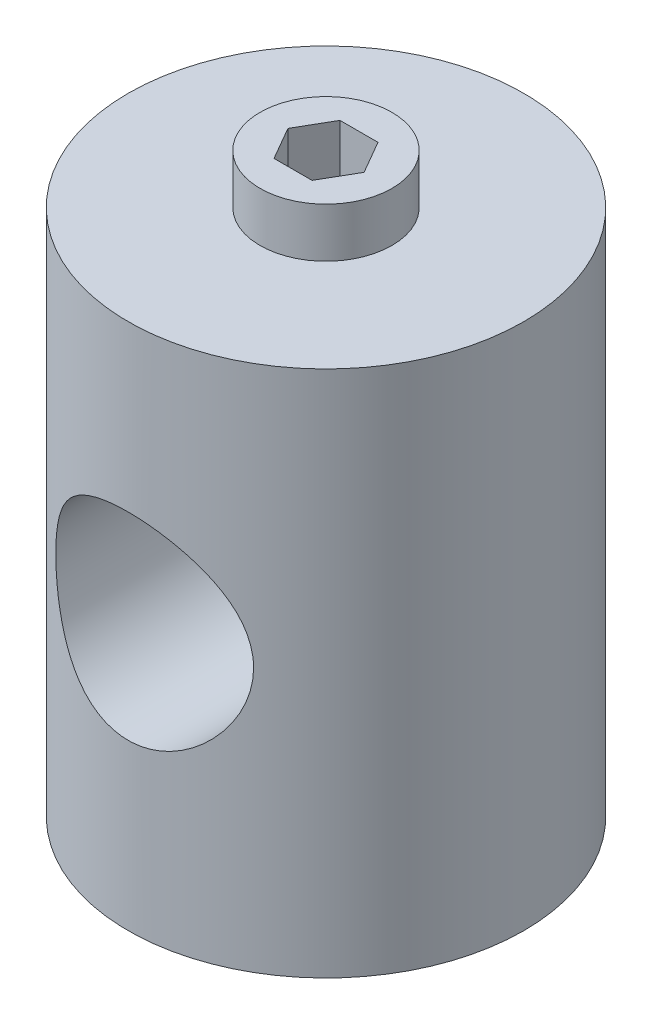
ISO-10303-21;
HEADER;
FILE_DESCRIPTION(('STEP AP214'),'2;1');
FILE_NAME('part.step','',(''),(''),'','','');
FILE_SCHEMA(('AUTOMOTIVE_DESIGN { 1 0 10303 214 1 1 1 1 }'));
ENDSEC;
DATA;
#1=APPLICATION_CONTEXT('core data for automotive mechanical design processes');
#2=APPLICATION_PROTOCOL_DEFINITION('international standard','automotive_design',2000,#1);
#3=PRODUCT_CONTEXT('',#1,'mechanical');
#4=PRODUCT('Part','Part','',(#3));
#5=PRODUCT_RELATED_PRODUCT_CATEGORY('part','',(#4));
#6=PRODUCT_DEFINITION_FORMATION('','',#4);
#7=PRODUCT_DEFINITION_CONTEXT('part definition',#1,'design');
#8=PRODUCT_DEFINITION('design','',#6,#7);
#9=PRODUCT_DEFINITION_SHAPE('','',#8);
#10=(LENGTH_UNIT() NAMED_UNIT(*) SI_UNIT(.MILLI.,.METRE.));
#11=(NAMED_UNIT(*) PLANE_ANGLE_UNIT() SI_UNIT($,.RADIAN.));
#12=(NAMED_UNIT(*) SI_UNIT($,.STERADIAN.) SOLID_ANGLE_UNIT());
#13=UNCERTAINTY_MEASURE_WITH_UNIT(LENGTH_MEASURE(1.E-05),#10,'distance_accuracy_value','');
#14=(GEOMETRIC_REPRESENTATION_CONTEXT(3) GLOBAL_UNCERTAINTY_ASSIGNED_CONTEXT((#13)) GLOBAL_UNIT_ASSIGNED_CONTEXT((#10,
#11,#12)) REPRESENTATION_CONTEXT('',''));
#15=CARTESIAN_POINT('',(0.,0.,0.));
#16=DIRECTION('',(0.,0.,1.));
#17=DIRECTION('',(1.,0.,0.));
#18=AXIS2_PLACEMENT_3D('',#15,#16,#17);
#19=CARTESIAN_POINT('',(-0.577350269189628,8.,-1.));
#20=DIRECTION('',(0.,-1.,0.));
#21=DIRECTION('',(1.,0.,0.));
#22=AXIS2_PLACEMENT_3D('',#19,#20,#21);
#23=PLANE('',#22);
#24=DIRECTION('',(-0.5,0.,0.866025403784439));
#25=VECTOR('',#24,1.);
#26=CARTESIAN_POINT('',(-0.577350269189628,8.,-1.));
#27=LINE('',#26,#25);
#28=CARTESIAN_POINT('',(-0.577350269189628,8.,-1.));
#29=VERTEX_POINT('',#28);
#30=CARTESIAN_POINT('',(-1.15470053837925,8.,0.));
#31=VERTEX_POINT('',#30);
#32=EDGE_CURVE('E169',#29,#31,#27,.T.);
#33=ORIENTED_EDGE('',*,*,#32,.T.);
#34=DIRECTION('',(0.5,0.,0.866025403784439));
#35=VECTOR('',#34,1.);
#36=CARTESIAN_POINT('',(-1.15470053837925,8.,0.));
#37=LINE('',#36,#35);
#38=CARTESIAN_POINT('',(-0.577350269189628,8.,1.));
#39=VERTEX_POINT('',#38);
#40=EDGE_CURVE('E91',#31,#39,#37,.T.);
#41=ORIENTED_EDGE('',*,*,#40,.T.);
#42=DIRECTION('',(1.,0.,0.));
#43=VECTOR('',#42,1.);
#44=CARTESIAN_POINT('',(-0.577350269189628,8.,1.));
#45=LINE('',#44,#43);
#46=CARTESIAN_POINT('',(0.577350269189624,8.,1.));
#47=VERTEX_POINT('',#46);
#48=EDGE_CURVE('E165',#39,#47,#45,.T.);
#49=ORIENTED_EDGE('',*,*,#48,.T.);
#50=DIRECTION('',(0.5,0.,-0.866025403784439));
#51=VECTOR('',#50,1.);
#52=CARTESIAN_POINT('',(0.577350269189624,8.,1.));
#53=LINE('',#52,#51);
#54=CARTESIAN_POINT('',(1.15470053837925,8.,0.));
#55=VERTEX_POINT('',#54);
#56=EDGE_CURVE('E162',#47,#55,#53,.T.);
#57=ORIENTED_EDGE('',*,*,#56,.T.);
#58=DIRECTION('',(-0.5,0.,-0.866025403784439));
#59=VECTOR('',#58,1.);
#60=CARTESIAN_POINT('',(1.15470053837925,8.,0.));
#61=LINE('',#60,#59);
#62=CARTESIAN_POINT('',(0.577350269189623,8.,-1.));
#63=VERTEX_POINT('',#62);
#64=EDGE_CURVE('E159',#55,#63,#61,.T.);
#65=ORIENTED_EDGE('',*,*,#64,.T.);
#66=DIRECTION('',(-1.,0.,0.));
#67=VECTOR('',#66,1.);
#68=CARTESIAN_POINT('',(0.577350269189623,8.,-1.));
#69=LINE('',#68,#67);
#70=EDGE_CURVE('E93',#63,#29,#69,.T.);
#71=ORIENTED_EDGE('',*,*,#70,.T.);
#72=EDGE_LOOP('',(#33,#41,#49,#57,#65,#71));
#73=FACE_BOUND('',#72,.T.);
#74=ADVANCED_FACE('F14',(#73),#23,.F.);
#75=CARTESIAN_POINT('',(-0.577350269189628,8.,1.));
#76=DIRECTION('',(0.,0.,1.));
#77=DIRECTION('',(1.,0.,0.));
#78=AXIS2_PLACEMENT_3D('',#75,#76,#77);
#79=PLANE('',#78);
#80=DIRECTION('',(1.,0.,0.));
#81=VECTOR('',#80,1.);
#82=CARTESIAN_POINT('',(-0.577350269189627,9.5,1.));
#83=LINE('',#82,#81);
#84=CARTESIAN_POINT('',(-0.577350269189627,9.5,1.));
#85=VERTEX_POINT('',#84);
#86=CARTESIAN_POINT('',(0.577350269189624,9.5,1.));
#87=VERTEX_POINT('',#86);
#88=EDGE_CURVE('E98',#85,#87,#83,.T.);
#89=ORIENTED_EDGE('',*,*,#88,.T.);
#90=DIRECTION('',(0.,1.,0.));
#91=VECTOR('',#90,1.);
#92=CARTESIAN_POINT('',(0.577350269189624,8.,1.));
#93=LINE('',#92,#91);
#94=EDGE_CURVE('E43',#47,#87,#93,.T.);
#95=ORIENTED_EDGE('',*,*,#94,.F.);
#96=ORIENTED_EDGE('',*,*,#48,.F.);
#97=DIRECTION('',(0.,1.,0.));
#98=VECTOR('',#97,1.);
#99=CARTESIAN_POINT('',(-0.577350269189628,8.,1.));
#100=LINE('',#99,#98);
#101=EDGE_CURVE('E35',#39,#85,#100,.T.);
#102=ORIENTED_EDGE('',*,*,#101,.T.);
#103=EDGE_LOOP('',(#89,#95,#96,#102));
#104=FACE_BOUND('',#103,.T.);
#105=ADVANCED_FACE('F182',(#104),#79,.F.);
#106=CARTESIAN_POINT('',(0.577350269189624,8.,1.));
#107=DIRECTION('',(0.866025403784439,0.,0.5));
#108=DIRECTION('',(0.5,0.,-0.866025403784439));
#109=AXIS2_PLACEMENT_3D('',#106,#107,#108);
#110=PLANE('',#109);
#111=DIRECTION('',(0.5,0.,-0.866025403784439));
#112=VECTOR('',#111,1.);
#113=CARTESIAN_POINT('',(0.577350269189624,9.5,1.));
#114=LINE('',#113,#112);
#115=CARTESIAN_POINT('',(1.15470053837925,9.5,0.));
#116=VERTEX_POINT('',#115);
#117=EDGE_CURVE('E100',#87,#116,#114,.T.);
#118=ORIENTED_EDGE('',*,*,#117,.T.);
#119=DIRECTION('',(0.,1.,0.));
#120=VECTOR('',#119,1.);
#121=CARTESIAN_POINT('',(1.15470053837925,8.,0.));
#122=LINE('',#121,#120);
#123=EDGE_CURVE('E152',#55,#116,#122,.T.);
#124=ORIENTED_EDGE('',*,*,#123,.F.);
#125=ORIENTED_EDGE('',*,*,#56,.F.);
#126=ORIENTED_EDGE('',*,*,#94,.T.);
#127=EDGE_LOOP('',(#118,#124,#125,#126));
#128=FACE_BOUND('',#127,.T.);
#129=ADVANCED_FACE('F176',(#128),#110,.F.);
#130=CARTESIAN_POINT('',(1.15470053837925,8.,0.));
#131=DIRECTION('',(0.866025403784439,0.,-0.5));
#132=DIRECTION('',(-0.5,0.,-0.866025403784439));
#133=AXIS2_PLACEMENT_3D('',#130,#131,#132);
#134=PLANE('',#133);
#135=DIRECTION('',(-0.5,0.,-0.866025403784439));
#136=VECTOR('',#135,1.);
#137=CARTESIAN_POINT('',(1.15470053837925,9.5,0.));
#138=LINE('',#137,#136);
#139=CARTESIAN_POINT('',(0.577350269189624,9.5,-1.));
#140=VERTEX_POINT('',#139);
#141=EDGE_CURVE('E173',#116,#140,#138,.T.);
#142=ORIENTED_EDGE('',*,*,#141,.T.);
#143=DIRECTION('',(0.,1.,0.));
#144=VECTOR('',#143,1.);
#145=CARTESIAN_POINT('',(0.577350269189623,8.,-1.));
#146=LINE('',#145,#144);
#147=EDGE_CURVE('E154',#63,#140,#146,.T.);
#148=ORIENTED_EDGE('',*,*,#147,.F.);
#149=ORIENTED_EDGE('',*,*,#64,.F.);
#150=ORIENTED_EDGE('',*,*,#123,.T.);
#151=EDGE_LOOP('',(#142,#148,#149,#150));
#152=FACE_BOUND('',#151,.T.);
#153=ADVANCED_FACE('F179',(#152),#134,.F.);
#154=CARTESIAN_POINT('',(0.577350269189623,8.,-1.));
#155=DIRECTION('',(0.,0.,-1.));
#156=DIRECTION('',(-1.,0.,0.));
#157=AXIS2_PLACEMENT_3D('',#154,#155,#156);
#158=PLANE('',#157);
#159=DIRECTION('',(-1.,0.,0.));
#160=VECTOR('',#159,1.);
#161=CARTESIAN_POINT('',(0.577350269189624,9.5,-1.));
#162=LINE('',#161,#160);
#163=CARTESIAN_POINT('',(-0.577350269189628,9.5,-1.));
#164=VERTEX_POINT('',#163);
#165=EDGE_CURVE('E171',#140,#164,#162,.T.);
#166=ORIENTED_EDGE('',*,*,#165,.T.);
#167=DIRECTION('',(0.,1.,0.));
#168=VECTOR('',#167,1.);
#169=CARTESIAN_POINT('',(-0.577350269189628,8.,-1.));
#170=LINE('',#169,#168);
#171=EDGE_CURVE('E79',#29,#164,#170,.T.);
#172=ORIENTED_EDGE('',*,*,#171,.F.);
#173=ORIENTED_EDGE('',*,*,#70,.F.);
#174=ORIENTED_EDGE('',*,*,#147,.T.);
#175=EDGE_LOOP('',(#166,#172,#173,#174));
#176=FACE_BOUND('',#175,.T.);
#177=ADVANCED_FACE('F273',(#176),#158,.F.);
#178=CARTESIAN_POINT('',(-0.577350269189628,8.,-1.));
#179=DIRECTION('',(-0.866025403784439,0.,-0.5));
#180=DIRECTION('',(-0.5,0.,0.866025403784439));
#181=AXIS2_PLACEMENT_3D('',#178,#179,#180);
#182=PLANE('',#181);
#183=DIRECTION('',(-0.5,0.,0.866025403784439));
#184=VECTOR('',#183,1.);
#185=CARTESIAN_POINT('',(-0.577350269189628,9.5,-1.));
#186=LINE('',#185,#184);
#187=CARTESIAN_POINT('',(-1.15470053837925,9.5,0.));
#188=VERTEX_POINT('',#187);
#189=EDGE_CURVE('E73',#164,#188,#186,.T.);
#190=ORIENTED_EDGE('',*,*,#189,.T.);
#191=DIRECTION('',(0.,1.,0.));
#192=VECTOR('',#191,1.);
#193=CARTESIAN_POINT('',(-1.15470053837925,8.,0.));
#194=LINE('',#193,#192);
#195=EDGE_CURVE('E77',#31,#188,#194,.T.);
#196=ORIENTED_EDGE('',*,*,#195,.F.);
#197=ORIENTED_EDGE('',*,*,#32,.F.);
#198=ORIENTED_EDGE('',*,*,#171,.T.);
#199=EDGE_LOOP('',(#190,#196,#197,#198));
#200=FACE_BOUND('',#199,.T.);
#201=ADVANCED_FACE('F75',(#200),#182,.F.);
#202=CARTESIAN_POINT('',(-1.15470053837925,8.,0.));
#203=DIRECTION('',(-0.866025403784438,0.,0.5));
#204=DIRECTION('',(0.5,0.,0.866025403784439));
#205=AXIS2_PLACEMENT_3D('',#202,#203,#204);
#206=PLANE('',#205);
#207=DIRECTION('',(0.5,0.,0.866025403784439));
#208=VECTOR('',#207,1.);
#209=CARTESIAN_POINT('',(-1.15470053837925,9.5,0.));
#210=LINE('',#209,#208);
#211=EDGE_CURVE('E85',#188,#85,#210,.T.);
#212=ORIENTED_EDGE('',*,*,#211,.T.);
#213=ORIENTED_EDGE('',*,*,#101,.F.);
#214=ORIENTED_EDGE('',*,*,#40,.F.);
#215=ORIENTED_EDGE('',*,*,#195,.T.);
#216=EDGE_LOOP('',(#212,#213,#214,#215));
#217=FACE_BOUND('',#216,.T.);
#218=ADVANCED_FACE('F88',(#217),#206,.F.);
#219=CARTESIAN_POINT('',(0.,9.5,0.));
#220=DIRECTION('',(0.,-1.,0.));
#221=DIRECTION('',(1.,0.,0.));
#222=AXIS2_PLACEMENT_3D('',#219,#220,#221);
#223=PLANE('',#222);
#224=ORIENTED_EDGE('',*,*,#211,.F.);
#225=ORIENTED_EDGE('',*,*,#189,.F.);
#226=ORIENTED_EDGE('',*,*,#165,.F.);
#227=ORIENTED_EDGE('',*,*,#141,.F.);
#228=ORIENTED_EDGE('',*,*,#117,.F.);
#229=ORIENTED_EDGE('',*,*,#88,.F.);
#230=EDGE_LOOP('',(#224,#225,#226,#227,#228,#229));
#231=FACE_BOUND('',#230,.T.);
#232=CARTESIAN_POINT('',(0.,9.5,0.));
#233=DIRECTION('',(0.,-1.,0.));
#234=DIRECTION('',(1.,0.,0.));
#235=AXIS2_PLACEMENT_3D('',#232,#233,#234);
#236=CIRCLE('',#235,2.);
#237=CARTESIAN_POINT('',(2.,9.5,0.));
#238=VERTEX_POINT('',#237);
#239=EDGE_CURVE('E147',#238,#238,#236,.T.);
#240=ORIENTED_EDGE('',*,*,#239,.F.);
#241=EDGE_LOOP('',(#240));
#242=FACE_BOUND('',#241,.T.);
#243=ADVANCED_FACE('F95',(#231,#242),#223,.F.);
#244=CARTESIAN_POINT('',(0.,5.5,0.));
#245=DIRECTION('',(0.,-1.,0.));
#246=DIRECTION('',(1.,0.,0.));
#247=AXIS2_PLACEMENT_3D('',#244,#245,#246);
#248=CYLINDRICAL_SURFACE('',#247,2.);
#249=ORIENTED_EDGE('',*,*,#239,.T.);
#250=EDGE_LOOP('',(#249));
#251=FACE_BOUND('',#250,.T.);
#252=CARTESIAN_POINT('',(0.,8.,0.));
#253=DIRECTION('',(0.,-1.,0.));
#254=DIRECTION('',(1.,0.,0.));
#255=AXIS2_PLACEMENT_3D('',#252,#253,#254);
#256=CIRCLE('',#255,2.);
#257=CARTESIAN_POINT('',(2.,8.,0.));
#258=VERTEX_POINT('',#257);
#259=EDGE_CURVE('E144',#258,#258,#256,.T.);
#260=ORIENTED_EDGE('',*,*,#259,.F.);
#261=EDGE_LOOP('',(#260));
#262=FACE_BOUND('',#261,.T.);
#263=ADVANCED_FACE('F131',(#251,#262),#248,.T.);
#264=CARTESIAN_POINT('',(0.,-8.,0.));
#265=DIRECTION('',(0.,-1.,0.));
#266=DIRECTION('',(1.,0.,0.));
#267=AXIS2_PLACEMENT_3D('',#264,#265,#266);
#268=PLANE('',#267);
#269=CARTESIAN_POINT('',(0.,-8.,0.));
#270=DIRECTION('',(0.,-1.,0.));
#271=DIRECTION('',(1.,0.,0.));
#272=AXIS2_PLACEMENT_3D('',#269,#270,#271);
#273=CIRCLE('',#272,6.);
#274=CARTESIAN_POINT('',(6.,-8.,0.));
#275=VERTEX_POINT('',#274);
#276=EDGE_CURVE('E111',#275,#275,#273,.T.);
#277=ORIENTED_EDGE('',*,*,#276,.T.);
#278=EDGE_LOOP('',(#277));
#279=FACE_BOUND('',#278,.T.);
#280=ADVANCED_FACE('F194',(#279),#268,.T.);
#281=CARTESIAN_POINT('',(0.,-8.,0.));
#282=DIRECTION('',(0.,1.,0.));
#283=DIRECTION('',(-1.,0.,0.));
#284=AXIS2_PLACEMENT_3D('',#281,#282,#283);
#285=CYLINDRICAL_SURFACE('',#284,6.);
#286=CARTESIAN_POINT('',(3.,0.,5.19615242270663));
#287=CARTESIAN_POINT('',(2.99999910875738,-0.0782002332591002,5.19615338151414));
#288=CARTESIAN_POINT('',(2.99693611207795,-0.156409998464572,5.19792581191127));
#289=CARTESIAN_POINT('',(2.98473565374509,-0.312208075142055,5.20493931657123));
#290=CARTESIAN_POINT('',(2.97559536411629,-0.389796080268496,5.21018200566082));
#291=CARTESIAN_POINT('',(2.9391691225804,-0.620944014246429,5.23088200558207));
#292=CARTESIAN_POINT('',(2.90287805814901,-0.772750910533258,5.25131076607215));
#293=CARTESIAN_POINT('',(2.80829998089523,-1.06639163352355,5.30247746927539));
#294=CARTESIAN_POINT('',(2.75012989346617,-1.2082738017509,5.33316051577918));
#295=CARTESIAN_POINT('',(2.61380253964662,-1.48026276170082,5.40128072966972));
#296=CARTESIAN_POINT('',(2.53564419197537,-1.61036891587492,5.43871826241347));
#297=CARTESIAN_POINT('',(2.35399963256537,-1.86692014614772,5.51990583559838));
#298=CARTESIAN_POINT('',(2.24895611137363,-1.99217820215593,5.56392184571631));
#299=CARTESIAN_POINT('',(2.01976141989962,-2.22422436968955,5.651159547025));
#300=CARTESIAN_POINT('',(1.89560077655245,-2.3310032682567,5.69438083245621));
#301=CARTESIAN_POINT('',(1.62146869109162,-2.53010168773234,5.77864428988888));
#302=CARTESIAN_POINT('',(1.47032156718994,-2.62096136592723,5.81934318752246));
#303=CARTESIAN_POINT('',(1.15247107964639,-2.77542249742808,5.89052268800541));
#304=CARTESIAN_POINT('',(0.985777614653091,-2.83904115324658,5.92100973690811));
#305=CARTESIAN_POINT('',(0.654134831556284,-2.93251399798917,5.96641383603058));
#306=CARTESIAN_POINT('',(0.489905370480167,-2.96444857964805,5.98228440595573));
#307=CARTESIAN_POINT('',(0.157711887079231,-3.00049835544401,6.00022751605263));
#308=CARTESIAN_POINT('',(-0.0102498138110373,-3.00463038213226,6.00230840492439));
#309=CARTESIAN_POINT('',(-0.32949757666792,-2.98575996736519,5.9928894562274));
#310=CARTESIAN_POINT('',(-0.48096360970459,-2.96508591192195,5.98255487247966));
#311=CARTESIAN_POINT('',(-0.77794130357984,-2.90135750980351,5.9512273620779));
#312=CARTESIAN_POINT('',(-0.923452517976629,-2.85830148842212,5.93023363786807));
#313=CARTESIAN_POINT('',(-1.20692822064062,-2.75075214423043,5.87914748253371));
#314=CARTESIAN_POINT('',(-1.34476044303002,-2.68597046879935,5.8489331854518));
#315=CARTESIAN_POINT('',(-1.60793023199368,-2.53721034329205,5.78212944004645));
#316=CARTESIAN_POINT('',(-1.73326330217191,-2.45322502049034,5.74553771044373));
#317=CARTESIAN_POINT('',(-1.98052168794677,-2.25931152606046,5.66533158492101));
#318=CARTESIAN_POINT('',(-2.10100497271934,-2.14768148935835,5.62138031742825));
#319=CARTESIAN_POINT('',(-2.32231036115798,-1.90624025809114,5.53363118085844));
#320=CARTESIAN_POINT('',(-2.42311733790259,-1.77641520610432,5.48983345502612));
#321=CARTESIAN_POINT('',(-2.6085269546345,-1.49201785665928,5.40432084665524));
#322=CARTESIAN_POINT('',(-2.691694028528,-1.33639756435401,5.36291485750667));
#323=CARTESIAN_POINT('',(-2.79542837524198,-1.09243694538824,5.30915194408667));
#324=CARTESIAN_POINT('',(-2.82650797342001,-1.00934368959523,5.2926194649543));
#325=CARTESIAN_POINT('',(-2.88131297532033,-0.840191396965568,5.26298473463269));
#326=CARTESIAN_POINT('',(-2.90504291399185,-0.754134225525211,5.24988036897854));
#327=CARTESIAN_POINT('',(-2.94323927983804,-0.586628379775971,5.22855455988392));
#328=CARTESIAN_POINT('',(-2.95828810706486,-0.505350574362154,5.22002982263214));
#329=CARTESIAN_POINT('',(-2.98163903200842,-0.341564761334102,5.20672737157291));
#330=CARTESIAN_POINT('',(-2.98994463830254,-0.259057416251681,5.20194770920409));
#331=CARTESIAN_POINT('',(-2.99968663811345,-0.0935289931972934,5.19633662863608));
#332=CARTESIAN_POINT('',(-3.00112558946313,-0.0105081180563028,5.19550374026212));
#333=CARTESIAN_POINT('',(-2.99712742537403,0.155286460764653,5.19780953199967));
#334=CARTESIAN_POINT('',(-2.99169077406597,0.238060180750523,5.20094794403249));
#335=CARTESIAN_POINT('',(-2.96710135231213,0.466859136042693,5.21504493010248));
#336=CARTESIAN_POINT('',(-2.9405616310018,0.611910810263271,5.23019160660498));
#337=CARTESIAN_POINT('',(-2.86709067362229,0.895130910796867,5.27081666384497));
#338=CARTESIAN_POINT('',(-2.82015283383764,1.03329709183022,5.29629839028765));
#339=CARTESIAN_POINT('',(-2.70494224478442,1.30622610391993,5.35608780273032));
#340=CARTESIAN_POINT('',(-2.63578205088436,1.4405349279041,5.3907496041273));
#341=CARTESIAN_POINT('',(-2.47886133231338,1.69640993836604,5.46468327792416));
#342=CARTESIAN_POINT('',(-2.3910912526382,1.81796953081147,5.50395751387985));
#343=CARTESIAN_POINT('',(-2.18651145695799,2.06093562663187,5.58864005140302));
#344=CARTESIAN_POINT('',(-2.067435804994,2.18039127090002,5.63419752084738));
#345=CARTESIAN_POINT('',(-1.8102134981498,2.39823689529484,5.72202702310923));
#346=CARTESIAN_POINT('',(-1.67206042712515,2.4966197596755,5.76429794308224));
#347=CARTESIAN_POINT('',(-1.37560608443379,2.67172112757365,5.84224085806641));
#348=CARTESIAN_POINT('',(-1.21686929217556,2.74779934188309,5.87770925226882));
#349=CARTESIAN_POINT('',(-0.886567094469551,2.87141372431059,5.93650064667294));
#350=CARTESIAN_POINT('',(-0.715013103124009,2.91897495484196,5.95983430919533));
#351=CARTESIAN_POINT('',(-0.380939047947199,2.98010569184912,5.9900252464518));
#352=CARTESIAN_POINT('',(-0.219034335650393,2.99639363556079,5.99819783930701));
#353=CARTESIAN_POINT('',(0.105377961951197,3.00252978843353,6.00126390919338));
#354=CARTESIAN_POINT('',(0.267885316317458,2.99238725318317,5.99616203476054));
#355=CARTESIAN_POINT('',(0.577613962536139,2.94775080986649,5.97401907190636));
#356=CARTESIAN_POINT('',(0.725136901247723,2.91490556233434,5.95778686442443));
#357=CARTESIAN_POINT('',(1.01233790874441,2.82801889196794,5.91576278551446));
#358=CARTESIAN_POINT('',(1.15201484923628,2.77397442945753,5.88996954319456));
#359=CARTESIAN_POINT('',(1.42627001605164,2.64381927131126,5.829778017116));
#360=CARTESIAN_POINT('',(1.56037465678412,2.56686365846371,5.79505887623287));
#361=CARTESIAN_POINT('',(1.81432469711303,2.39412457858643,5.7206436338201));
#362=CARTESIAN_POINT('',(1.93416350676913,2.29833246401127,5.6809452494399));
#363=CARTESIAN_POINT('',(2.16873884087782,2.07961527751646,5.59585978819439));
#364=CARTESIAN_POINT('',(2.28178066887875,1.9549386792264,5.55029975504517));
#365=CARTESIAN_POINT('',(2.48600225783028,1.68762167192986,5.46188649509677));
#366=CARTESIAN_POINT('',(2.57716267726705,1.54496553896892,5.41903568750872));
#367=CARTESIAN_POINT('',(2.69665559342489,1.31746820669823,5.36004774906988));
#368=CARTESIAN_POINT('',(2.73405408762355,1.23802419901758,5.34101219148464));
#369=CARTESIAN_POINT('',(2.80191257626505,1.07564671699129,5.30572783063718));
#370=CARTESIAN_POINT('',(2.83237614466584,0.992715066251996,5.28947759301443));
#371=CARTESIAN_POINT('',(2.88592624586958,0.824155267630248,5.26045215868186));
#372=CARTESIAN_POINT('',(2.90903175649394,0.738534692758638,5.24766803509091));
#373=CARTESIAN_POINT('',(2.9476242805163,0.565144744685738,5.22608869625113));
#374=CARTESIAN_POINT('',(2.96311662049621,0.47737691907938,5.21729069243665));
#375=CARTESIAN_POINT('',(2.9830938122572,0.324601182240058,5.20588528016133));
#376=CARTESIAN_POINT('',(2.9894274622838,0.259905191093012,5.20224442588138));
#377=CARTESIAN_POINT('',(2.99788106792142,0.130141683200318,5.19737751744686));
#378=CARTESIAN_POINT('',(3.00000074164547,0.0650741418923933,5.1961516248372));
#379=CARTESIAN_POINT('',(3.,0.,5.19615242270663));
#380=B_SPLINE_CURVE_WITH_KNOTS('',3,(#286,#287,#288,#289,#290,#291,#292,#293,#294,#295,#296,
#297,#298,#299,#300,#301,#302,#303,#304,#305,#306,#307,#308,#309,#310,#311,#312,#313,#314,#315,
#316,#317,#318,#319,#320,#321,#322,#323,#324,#325,#326,#327,#328,#329,#330,#331,#332,#333,#334,
#335,#336,#337,#338,#339,#340,#341,#342,#343,#344,#345,#346,#347,#348,#349,#350,#351,#352,#353,
#354,#355,#356,#357,#358,#359,#360,#361,#362,#363,#364,#365,#366,#367,#368,#369,#370,#371,#372,
#373,#374,#375,#376,#377,#378,#379),.UNSPECIFIED.,.T.,.F.,(4,2,2,2,2,2,2,2,2,2,2,2,2,2,2,2,2,2,
2,2,2,2,2,2,2,2,2,2,2,2,2,2,2,2,2,2,2,2,2,2,2,2,2,2,2,2,4),(0.,0.234529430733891,
0.469168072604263,0.93885038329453,1.40605749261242,1.87328988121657,2.37905864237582,
2.88507883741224,3.42520847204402,3.96499651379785,4.46637625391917,4.96745241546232,
5.42495462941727,5.88249108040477,6.34635774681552,6.81039068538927,7.31828744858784,
7.82657315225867,8.36713695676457,8.63752916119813,8.90775419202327,9.15669600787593,
9.40550821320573,9.65422772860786,9.90293045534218,10.3454331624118,10.7880792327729,
11.2512265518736,11.7146122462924,12.2364099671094,12.7583836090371,13.29413310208,
13.8294110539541,14.3155757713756,14.8015702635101,15.2555404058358,15.7095756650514,
16.1830301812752,16.6567025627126,17.177514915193,17.6987859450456,17.9680115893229,
18.2370981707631,18.5054849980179,18.7736837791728,18.9688338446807,19.1639969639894),.UNSPECIFIED.);
#381=CARTESIAN_POINT('',(3.,0.,5.19615242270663));
#382=VERTEX_POINT('',#381);
#383=EDGE_CURVE('E28',#382,#382,#380,.T.);
#384=ORIENTED_EDGE('',*,*,#383,.T.);
#385=EDGE_LOOP('',(#384));
#386=FACE_BOUND('',#385,.T.);
#387=CARTESIAN_POINT('',(0.,3.,-6.));
#388=CARTESIAN_POINT('',(-0.0788941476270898,2.99999916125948,-5.99999934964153));
#389=CARTESIAN_POINT('',(-0.15779662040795,2.99688205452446,-5.99843869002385));
#390=CARTESIAN_POINT('',(-0.315001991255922,2.98446072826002,-5.99224358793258));
#391=CARTESIAN_POINT('',(-0.393304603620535,2.97515372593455,-5.98760776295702));
#392=CARTESIAN_POINT('',(-0.626628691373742,2.93804214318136,-5.96921978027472));
#393=CARTESIAN_POINT('',(-0.779952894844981,2.90104717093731,-5.95098734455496));
#394=CARTESIAN_POINT('',(-1.07683586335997,2.80441822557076,-5.90448966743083));
#395=CARTESIAN_POINT('',(-1.22043005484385,2.74487223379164,-5.87626344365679));
#396=CARTESIAN_POINT('',(-1.49540820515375,2.60528874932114,-5.81237302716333));
#397=CARTESIAN_POINT('',(-1.62679312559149,2.52525287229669,-5.77670942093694));
#398=CARTESIAN_POINT('',(-1.88252701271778,2.34144601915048,-5.69868752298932));
#399=CARTESIAN_POINT('',(-2.0059694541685,2.23653205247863,-5.65605474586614));
#400=CARTESIAN_POINT('',(-2.23433451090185,2.00844407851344,-5.5698003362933));
#401=CARTESIAN_POINT('',(-2.3392430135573,1.88525628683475,-5.52617797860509));
#402=CARTESIAN_POINT('',(-2.53576864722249,1.61251563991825,-5.43896347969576));
#403=CARTESIAN_POINT('',(-2.62572411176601,1.46165902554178,-5.39563602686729));
#404=CARTESIAN_POINT('',(-2.7403403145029,1.22404914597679,-5.33782449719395));
#405=CARTESIAN_POINT('',(-2.77516786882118,1.14292907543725,-5.31974570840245));
#406=CARTESIAN_POINT('',(-2.83769299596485,0.977399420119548,-5.28665768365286));
#407=CARTESIAN_POINT('',(-2.86539478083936,0.892991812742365,-5.27164663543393));
#408=CARTESIAN_POINT('',(-2.91188280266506,0.72660420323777,-5.24610341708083));
#409=CARTESIAN_POINT('',(-2.93110042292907,0.644777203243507,-5.23535838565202));
#410=CARTESIAN_POINT('',(-2.9626355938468,0.479445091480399,-5.21757784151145));
#411=CARTESIAN_POINT('',(-2.97495680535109,0.395940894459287,-5.21054036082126));
#412=CARTESIAN_POINT('',(-2.99251382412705,0.227993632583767,-5.20047756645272));
#413=CARTESIAN_POINT('',(-2.99775389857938,0.143551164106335,-5.19744983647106));
#414=CARTESIAN_POINT('',(-3.00108452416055,-0.02549365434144,-5.19552555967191));
#415=CARTESIAN_POINT('',(-2.99917575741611,-0.110095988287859,-5.19662861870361));
#416=CARTESIAN_POINT('',(-2.98404973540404,-0.342753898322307,-5.20534668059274));
#417=CARTESIAN_POINT('',(-2.96335042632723,-0.49024415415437,-5.21726794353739));
#418=CARTESIAN_POINT('',(-2.90082280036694,-0.779193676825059,-5.25228182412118));
#419=CARTESIAN_POINT('',(-2.85898775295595,-0.920651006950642,-5.27537800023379));
#420=CARTESIAN_POINT('',(-2.75462843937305,-1.19767965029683,-5.33062568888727));
#421=CARTESIAN_POINT('',(-2.69164495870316,-1.33303711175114,-5.36297559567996));
#422=CARTESIAN_POINT('',(-2.54712530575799,-1.59190496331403,-5.43310175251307));
#423=CARTESIAN_POINT('',(-2.46558080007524,-1.71540999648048,-5.47088043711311));
#424=CARTESIAN_POINT('',(-2.27419808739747,-1.96356309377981,-5.55339485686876));
#425=CARTESIAN_POINT('',(-2.16208335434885,-2.0863704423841,-5.59840533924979));
#426=CARTESIAN_POINT('',(-1.91866675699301,-2.31220643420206,-5.68642866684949));
#427=CARTESIAN_POINT('',(-1.78735577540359,-2.41522562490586,-5.72944054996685));
#428=CARTESIAN_POINT('',(-1.50154951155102,-2.60305693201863,-5.81105962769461));
#429=CARTESIAN_POINT('',(-1.3462607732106,-2.68680140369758,-5.84936952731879));
#430=CARTESIAN_POINT('',(-1.02139864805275,-2.82629110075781,-5.91473643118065));
#431=CARTESIAN_POINT('',(-0.851836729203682,-2.88205855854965,-5.94180236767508));
#432=CARTESIAN_POINT('',(-0.518299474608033,-2.95942620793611,-5.97973001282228));
#433=CARTESIAN_POINT('',(-0.355024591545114,-2.98347370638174,-5.99174814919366));
#434=CARTESIAN_POINT('',(-0.0263387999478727,-3.00439419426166,-6.00219040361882));
#435=CARTESIAN_POINT('',(0.139071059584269,-3.00128005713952,-6.00062096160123));
#436=CARTESIAN_POINT('',(0.453698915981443,-2.96937993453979,-5.98473576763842));
#437=CARTESIAN_POINT('',(0.603178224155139,-2.94260240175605,-5.97141737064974));
#438=CARTESIAN_POINT('',(0.895220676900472,-2.86728578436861,-5.93466513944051));
#439=CARTESIAN_POINT('',(1.03778305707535,-2.81874430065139,-5.91123019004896));
#440=CARTESIAN_POINT('',(1.31666582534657,-2.7000046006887,-5.85552754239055));
#441=CARTESIAN_POINT('',(1.45269119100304,-2.62922684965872,-5.82302645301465));
#442=CARTESIAN_POINT('',(1.71138408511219,-2.46867739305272,-5.75231922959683));
#443=CARTESIAN_POINT('',(1.83404588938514,-2.37889759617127,-5.71411066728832));
#444=CARTESIAN_POINT('',(2.07530306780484,-2.17271872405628,-5.63124663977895));
#445=CARTESIAN_POINT('',(2.19231623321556,-2.05457139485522,-5.58632654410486));
#446=CARTESIAN_POINT('',(2.40556896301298,-1.8002245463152,-5.49787174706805));
#447=CARTESIAN_POINT('',(2.50179415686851,-1.66401264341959,-5.45433802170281));
#448=CARTESIAN_POINT('',(2.675123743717,-1.36906903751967,-5.3715357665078));
#449=CARTESIAN_POINT('',(2.75107648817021,-1.20956620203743,-5.33257588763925));
#450=CARTESIAN_POINT('',(2.87424847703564,-0.877469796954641,-5.26722216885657));
#451=CARTESIAN_POINT('',(2.92150474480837,-0.704893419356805,-5.24081214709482));
#452=CARTESIAN_POINT('',(2.98158506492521,-0.369269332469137,-5.2068450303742));
#453=CARTESIAN_POINT('',(2.997278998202,-0.206897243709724,-5.19772150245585));
#454=CARTESIAN_POINT('',(3.00206745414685,0.118341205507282,-5.19496064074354));
#455=CARTESIAN_POINT('',(2.99117350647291,0.281207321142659,-5.20131659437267));
#456=CARTESIAN_POINT('',(2.94577840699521,0.586450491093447,-5.22713585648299));
#457=CARTESIAN_POINT('',(2.91362505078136,0.729301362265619,-5.24529281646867));
#458=CARTESIAN_POINT('',(2.82952596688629,1.0074244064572,-5.29113050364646));
#459=CARTESIAN_POINT('',(2.77757387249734,1.14269412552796,-5.3188142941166));
#460=CARTESIAN_POINT('',(2.65144766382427,1.41187436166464,-5.38285583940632));
#461=CARTESIAN_POINT('',(2.57601505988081,1.54508296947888,-5.41967139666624));
#462=CARTESIAN_POINT('',(2.40645126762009,1.7978243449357,-5.49706022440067));
#463=CARTESIAN_POINT('',(2.31231035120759,1.9173499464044,-5.5376354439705));
#464=CARTESIAN_POINT('',(2.094616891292,2.15442285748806,-5.62386853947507));
#465=CARTESIAN_POINT('',(1.96888052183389,2.26996512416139,-5.66954494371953));
#466=CARTESIAN_POINT('',(1.69843715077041,2.47880114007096,-5.75633712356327));
#467=CARTESIAN_POINT('',(1.55371998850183,2.57208289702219,-5.79745043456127));
#468=CARTESIAN_POINT('',(1.32452333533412,2.69317818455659,-5.85251406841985));
#469=CARTESIAN_POINT('',(1.24575314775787,2.73052020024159,-5.86982524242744));
#470=CARTESIAN_POINT('',(1.08479725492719,2.79836167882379,-5.90168845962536));
#471=CARTESIAN_POINT('',(1.00261324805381,2.82886449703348,-5.91624185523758));
#472=CARTESIAN_POINT('',(0.835616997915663,2.88260725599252,-5.94212690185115));
#473=CARTESIAN_POINT('',(0.750810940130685,2.90586304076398,-5.95346557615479));
#474=CARTESIAN_POINT('',(0.579142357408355,2.94488257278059,-5.97260771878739));
#475=CARTESIAN_POINT('',(0.49228112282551,2.96065089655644,-5.9804133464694));
#476=CARTESIAN_POINT('',(0.337824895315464,2.98168467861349,-5.99085829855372));
#477=CARTESIAN_POINT('',(0.270495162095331,2.98854691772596,-5.99428035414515));
#478=CARTESIAN_POINT('',(0.135445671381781,2.99770500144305,-5.99885151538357));
#479=CARTESIAN_POINT('',(0.0677259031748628,3.00000072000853,-6.00000055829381));
#480=CARTESIAN_POINT('',(0.,3.,-6.));
#481=B_SPLINE_CURVE_WITH_KNOTS('',3,(#387,#388,#389,#390,#391,#392,#393,#394,#395,#396,#397,
#398,#399,#400,#401,#402,#403,#404,#405,#406,#407,#408,#409,#410,#411,#412,#413,#414,#415,#416,
#417,#418,#419,#420,#421,#422,#423,#424,#425,#426,#427,#428,#429,#430,#431,#432,#433,#434,#435,
#436,#437,#438,#439,#440,#441,#442,#443,#444,#445,#446,#447,#448,#449,#450,#451,#452,#453,#454,
#455,#456,#457,#458,#459,#460,#461,#462,#463,#464,#465,#466,#467,#468,#469,#470,#471,#472,#473,
#474,#475,#476,#477,#478,#479,#480),.UNSPECIFIED.,.T.,.F.,(4,2,2,2,2,2,2,2,2,2,2,2,2,2,2,2,2,2,
2,2,2,2,2,2,2,2,2,2,2,2,2,2,2,2,2,2,2,2,2,2,2,2,2,2,2,2,4),(0.,0.236611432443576,
0.473329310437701,0.947100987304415,1.41904300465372,1.89094781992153,2.39140181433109,
2.89223525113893,3.4319083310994,3.70192714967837,3.97178599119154,4.2256372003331,
4.47935352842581,4.73291689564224,4.98645606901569,5.43238672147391,5.87845946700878,
6.33492255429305,6.79159098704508,7.30616358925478,7.82098138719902,8.35970601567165,
8.89800185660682,9.3917140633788,9.88519228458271,10.3404225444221,10.7957029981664,
11.2640010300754,11.7324988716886,12.2470036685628,12.7618630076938,13.3016558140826,
13.8407507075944,14.3280945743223,14.8152271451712,15.2559532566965,15.6968212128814,
16.1673090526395,16.6380421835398,17.1659726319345,17.6941868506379,17.9605054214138,
18.2266930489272,18.4922945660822,18.7577335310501,18.9608446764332,19.1639614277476),.UNSPECIFIED.);
#482=CARTESIAN_POINT('',(0.,3.,-6.));
#483=VERTEX_POINT('',#482);
#484=EDGE_CURVE('E9',#483,#483,#481,.T.);
#485=ORIENTED_EDGE('',*,*,#484,.T.);
#486=EDGE_LOOP('',(#485));
#487=FACE_BOUND('',#486,.T.);
#488=ORIENTED_EDGE('',*,*,#276,.F.);
#489=EDGE_LOOP('',(#488));
#490=FACE_BOUND('',#489,.T.);
#491=CARTESIAN_POINT('',(0.,8.,0.));
#492=DIRECTION('',(0.,-1.,0.));
#493=DIRECTION('',(1.,0.,0.));
#494=AXIS2_PLACEMENT_3D('',#491,#492,#493);
#495=CIRCLE('',#494,6.);
#496=CARTESIAN_POINT('',(6.,8.,0.));
#497=VERTEX_POINT('',#496);
#498=EDGE_CURVE('E114',#497,#497,#495,.T.);
#499=ORIENTED_EDGE('',*,*,#498,.T.);
#500=EDGE_LOOP('',(#499));
#501=FACE_BOUND('',#500,.T.);
#502=ADVANCED_FACE('F120',(#386,#487,#490,#501),#285,.T.);
#503=CARTESIAN_POINT('',(0.,8.,0.));
#504=DIRECTION('',(0.,-1.,0.));
#505=DIRECTION('',(1.,0.,0.));
#506=AXIS2_PLACEMENT_3D('',#503,#504,#505);
#507=PLANE('',#506);
#508=ORIENTED_EDGE('',*,*,#498,.F.);
#509=EDGE_LOOP('',(#508));
#510=FACE_BOUND('',#509,.T.);
#511=ORIENTED_EDGE('',*,*,#259,.T.);
#512=EDGE_LOOP('',(#511));
#513=FACE_BOUND('',#512,.T.);
#514=ADVANCED_FACE('F129',(#510,#513),#507,.F.);
#515=CARTESIAN_POINT('',(0.,0.,-6.));
#516=DIRECTION('',(0.,0.,1.));
#517=DIRECTION('',(1.,0.,0.));
#518=AXIS2_PLACEMENT_3D('',#515,#516,#517);
#519=CYLINDRICAL_SURFACE('',#518,3.);
#520=ORIENTED_EDGE('',*,*,#484,.F.);
#521=EDGE_LOOP('',(#520));
#522=FACE_BOUND('',#521,.T.);
#523=ORIENTED_EDGE('',*,*,#383,.F.);
#524=EDGE_LOOP('',(#523));
#525=FACE_BOUND('',#524,.T.);
#526=CARTESIAN_POINT('',(-1.65,2.50549396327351,0.));
#527=CARTESIAN_POINT('',(-1.64999358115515,2.50550290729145,-0.0845622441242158));
#528=CARTESIAN_POINT('',(-1.64345412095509,2.50984278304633,-0.169198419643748));
#529=CARTESIAN_POINT('',(-1.61768357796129,2.52652305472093,-0.335758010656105));
#530=CARTESIAN_POINT('',(-1.59843109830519,2.5388769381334,-0.417676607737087));
#531=CARTESIAN_POINT('',(-1.54839133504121,2.56969514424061,-0.576058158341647));
#532=CARTESIAN_POINT('',(-1.51767597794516,2.58812128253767,-0.652551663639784));
#533=CARTESIAN_POINT('',(-1.44580368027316,2.62894573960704,-0.799270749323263));
#534=CARTESIAN_POINT('',(-1.40464456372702,2.65134488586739,-0.869495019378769));
#535=CARTESIAN_POINT('',(-1.30818987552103,2.70034227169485,-1.00949302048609));
#536=CARTESIAN_POINT('',(-1.25188597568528,2.72713610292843,-1.07850385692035));
#537=CARTESIAN_POINT('',(-1.12882249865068,2.78033402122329,-1.20671542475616));
#538=CARTESIAN_POINT('',(-1.06205670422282,2.8067378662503,-1.26591027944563));
#539=CARTESIAN_POINT('',(-0.912984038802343,2.85888255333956,-1.37781278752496));
#540=CARTESIAN_POINT('',(-0.829835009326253,2.88437182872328,-1.42952708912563));
#541=CARTESIAN_POINT('',(-0.654349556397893,2.92916377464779,-1.51787790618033));
#542=CARTESIAN_POINT('',(-0.562020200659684,2.94847115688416,-1.55452591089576));
#543=CARTESIAN_POINT('',(-0.378922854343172,2.97729382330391,-1.60849398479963));
#544=CARTESIAN_POINT('',(-0.288663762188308,2.98749000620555,-1.62716814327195));
#545=CARTESIAN_POINT('',(-0.105768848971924,2.99953120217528,-1.64917477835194));
#546=CARTESIAN_POINT('',(-0.0131348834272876,3.00138254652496,-1.65251888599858));
#547=CARTESIAN_POINT('',(0.161456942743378,2.99679126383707,-1.6441598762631));
#548=CARTESIAN_POINT('',(0.243517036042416,2.99119680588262,-1.63399569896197));
#549=CARTESIAN_POINT('',(0.404548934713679,2.97370139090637,-1.60174386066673));
#550=CARTESIAN_POINT('',(0.483520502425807,2.96179994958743,-1.57965528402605));
#551=CARTESIAN_POINT('',(0.637279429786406,2.93258792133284,-1.5241824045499));
#552=CARTESIAN_POINT('',(0.712012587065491,2.91522047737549,-1.49067904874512));
#553=CARTESIAN_POINT('',(0.854941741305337,2.87655421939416,-1.41356855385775));
#554=CARTESIAN_POINT('',(0.923135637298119,2.85525414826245,-1.36995818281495));
#555=CARTESIAN_POINT('',(1.05891717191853,2.80791814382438,-1.26851524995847));
#556=CARTESIAN_POINT('',(1.12564617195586,2.78161920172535,-1.2096560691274));
#557=CARTESIAN_POINT('',(1.24879377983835,2.72855637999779,-1.08207579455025));
#558=CARTESIAN_POINT('',(1.30520164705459,2.70179204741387,-1.01334455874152));
#559=CARTESIAN_POINT('',(1.41104757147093,2.64816260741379,-0.86070204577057));
#560=CARTESIAN_POINT('',(1.45943898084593,2.62149493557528,-0.775987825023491));
#561=CARTESIAN_POINT('',(1.54096072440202,2.57442669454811,-0.597912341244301));
#562=CARTESIAN_POINT('',(1.57410870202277,2.55401888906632,-0.504561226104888));
#563=CARTESIAN_POINT('',(1.621324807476,2.52428868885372,-0.319617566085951));
#564=CARTESIAN_POINT('',(1.63671808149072,2.51420388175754,-0.228492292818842));
#565=CARTESIAN_POINT('',(1.65197600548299,2.50421132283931,-0.044438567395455));
#566=CARTESIAN_POINT('',(1.65185841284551,2.50429193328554,0.0484877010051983));
#567=CARTESIAN_POINT('',(1.63731066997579,2.51381291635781,0.218980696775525));
#568=CARTESIAN_POINT('',(1.6249632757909,2.52189118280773,0.296816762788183));
#569=CARTESIAN_POINT('',(1.58963092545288,2.54430898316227,0.449094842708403));
#570=CARTESIAN_POINT('',(1.56664130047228,2.55865126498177,0.523535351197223));
#571=CARTESIAN_POINT('',(1.50974087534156,2.59264701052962,0.670568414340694));
#572=CARTESIAN_POINT('',(1.47541058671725,2.61249886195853,0.742950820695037));
#573=CARTESIAN_POINT('',(1.39715088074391,2.65517525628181,0.881361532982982));
#574=CARTESIAN_POINT('',(1.35321671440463,2.67800126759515,0.947386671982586));
#575=CARTESIAN_POINT('',(1.24890384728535,2.72838745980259,1.08217598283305));
#576=CARTESIAN_POINT('',(1.18702256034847,2.75612471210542,1.14971665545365));
#577=CARTESIAN_POINT('',(1.05259034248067,2.81021466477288,1.27394463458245));
#578=CARTESIAN_POINT('',(0.980033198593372,2.83656654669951,1.33062557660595));
#579=CARTESIAN_POINT('',(0.821591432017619,2.88655886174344,1.43418356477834));
#580=CARTESIAN_POINT('',(0.735218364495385,2.90999476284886,1.48041980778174));
#581=CARTESIAN_POINT('',(0.554269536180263,2.94980224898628,1.55721430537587));
#582=CARTESIAN_POINT('',(0.459702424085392,2.96618117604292,1.58778886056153));
#583=CARTESIAN_POINT('',(0.275417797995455,2.98862325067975,1.62930611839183));
#584=CARTESIAN_POINT('',(0.186187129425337,2.99556705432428,1.64193096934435));
#585=CARTESIAN_POINT('',(0.00661676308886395,3.00133436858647,1.65243189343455));
#586=CARTESIAN_POINT('',(-0.0837223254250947,3.00016215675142,1.65031573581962));
#587=CARTESIAN_POINT('',(-0.254358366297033,2.99031042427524,1.63233007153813));
#588=CARTESIAN_POINT('',(-0.334831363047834,2.98231104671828,1.61770633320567));
#589=CARTESIAN_POINT('',(-0.491985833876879,2.96044701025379,1.57703517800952));
#590=CARTESIAN_POINT('',(-0.568666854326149,2.94658165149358,1.55098639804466));
#591=CARTESIAN_POINT('',(-0.719080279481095,2.91359875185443,1.48738736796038));
#592=CARTESIAN_POINT('',(-0.792622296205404,2.89431787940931,1.44947440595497));
#593=CARTESIAN_POINT('',(-0.932542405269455,2.85231650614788,1.36367449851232));
#594=CARTESIAN_POINT('',(-0.99891758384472,2.82959461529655,1.31578351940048));
#595=CARTESIAN_POINT('',(-1.13072210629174,2.77974517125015,1.20507399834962));
#596=CARTESIAN_POINT('',(-1.19516495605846,2.75241145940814,1.14117216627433));
#597=CARTESIAN_POINT('',(-1.31290440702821,2.69823878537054,1.00349286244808));
#598=CARTESIAN_POINT('',(-1.36618742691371,2.67140046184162,0.929703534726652));
#599=CARTESIAN_POINT('',(-1.46345962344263,2.61945108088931,0.76827599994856));
#600=CARTESIAN_POINT('',(-1.50659692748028,2.59457299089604,0.680043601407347));
#601=CARTESIAN_POINT('',(-1.57680093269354,2.55252885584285,0.495821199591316));
#602=CARTESIAN_POINT('',(-1.60391885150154,2.53533827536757,0.399857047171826));
#603=CARTESIAN_POINT('',(-1.6313948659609,2.5176692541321,0.252191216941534));
#604=CARTESIAN_POINT('',(-1.6383544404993,2.51313062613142,0.202125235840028));
#605=CARTESIAN_POINT('',(-1.64765888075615,2.50704033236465,0.101381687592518));
#606=CARTESIAN_POINT('',(-1.65000384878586,2.50548860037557,0.0507041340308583));
#607=CARTESIAN_POINT('',(-1.65,2.50549396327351,0.));
#608=B_SPLINE_CURVE_WITH_KNOTS('',3,(#526,#527,#528,#529,#530,#531,#532,#533,#534,#535,#536,
#537,#538,#539,#540,#541,#542,#543,#544,#545,#546,#547,#548,#549,#550,#551,#552,#553,#554,#555,
#556,#557,#558,#559,#560,#561,#562,#563,#564,#565,#566,#567,#568,#569,#570,#571,#572,#573,#574,
#575,#576,#577,#578,#579,#580,#581,#582,#583,#584,#585,#586,#587,#588,#589,#590,#591,#592,#593,
#594,#595,#596,#597,#598,#599,#600,#601,#602,#603,#604,#605,#606,#607),.UNSPECIFIED.,.T.,.F.,(4,
2,2,2,2,2,2,2,2,2,2,2,2,2,2,2,2,2,2,2,2,2,2,2,2,2,2,2,2,2,2,2,2,2,2,2,2,2,2,2,4),(0.,
0.253471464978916,0.507370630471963,0.759702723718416,1.01208743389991,1.28998079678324,
1.56803993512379,1.8699728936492,2.17167517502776,2.44828286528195,2.72468065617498,
2.9721366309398,3.21961160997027,3.46975098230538,3.71997045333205,3.99717687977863,
4.27467015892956,4.57652503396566,4.8780296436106,5.15517475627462,5.43200258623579,
5.66859462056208,5.90529054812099,6.15196333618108,6.39875837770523,6.68465599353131,
6.97072065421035,7.27125286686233,7.57147164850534,7.84111747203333,8.1106211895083,
8.35604451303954,8.60149712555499,8.85533990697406,9.10928550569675,9.39243346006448,
9.67592402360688,9.97823556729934,10.2795752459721,10.4315619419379,10.5835452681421),.UNSPECIFIED.);
#609=CARTESIAN_POINT('',(-1.65,2.50549396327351,0.));
#610=VERTEX_POINT('',#609);
#611=EDGE_CURVE('E108',#610,#610,#608,.T.);
#612=ORIENTED_EDGE('',*,*,#611,.F.);
#613=EDGE_LOOP('',(#612));
#614=FACE_BOUND('',#613,.T.);
#615=ADVANCED_FACE('F124',(#522,#525,#614),#519,.F.);
#616=CARTESIAN_POINT('',(0.,3.,0.));
#617=DIRECTION('',(0.,1.,0.));
#618=DIRECTION('',(-0.99981281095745,0.,0.0193479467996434));
#619=AXIS2_PLACEMENT_3D('',#616,#617,#618);
#620=PLANE('',#619);
#621=CARTESIAN_POINT('',(0.,3.,0.));
#622=DIRECTION('',(0.,1.,0.));
#623=DIRECTION('',(-0.99981281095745,0.,0.0193479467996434));
#624=AXIS2_PLACEMENT_3D('',#621,#622,#623);
#625=CIRCLE('',#624,1.5);
#626=CARTESIAN_POINT('',(-1.49971921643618,3.,0.0290219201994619));
#627=VERTEX_POINT('',#626);
#628=EDGE_CURVE('E84',#627,#627,#625,.T.);
#629=ORIENTED_EDGE('',*,*,#628,.F.);
#630=EDGE_LOOP('',(#629));
#631=FACE_BOUND('',#630,.T.);
#632=ADVANCED_FACE('F128',(#631),#620,.F.);
#633=CARTESIAN_POINT('',(0.,5.5,0.));
#634=DIRECTION('',(0.,-1.,0.));
#635=DIRECTION('',(0.99981281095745,0.,-0.0193479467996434));
#636=AXIS2_PLACEMENT_3D('',#633,#634,#635);
#637=CYLINDRICAL_SURFACE('',#636,1.5);
#638=CARTESIAN_POINT('',(0.,5.5,0.));
#639=DIRECTION('',(0.,1.,0.));
#640=DIRECTION('',(-0.99981281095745,0.,0.0193479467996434));
#641=AXIS2_PLACEMENT_3D('',#638,#639,#640);
#642=CIRCLE('',#641,1.5);
#643=CARTESIAN_POINT('',(-1.49971921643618,5.5,0.0290219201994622));
#644=VERTEX_POINT('',#643);
#645=EDGE_CURVE('E104',#644,#644,#642,.T.);
#646=ORIENTED_EDGE('',*,*,#645,.F.);
#647=EDGE_LOOP('',(#646));
#648=FACE_BOUND('',#647,.T.);
#649=ORIENTED_EDGE('',*,*,#628,.T.);
#650=EDGE_LOOP('',(#649));
#651=FACE_BOUND('',#650,.T.);
#652=ADVANCED_FACE('F232',(#648,#651),#637,.T.);
#653=CARTESIAN_POINT('',(0.,5.5,0.));
#654=DIRECTION('',(0.,1.,0.));
#655=DIRECTION('',(-1.,0.,0.));
#656=AXIS2_PLACEMENT_3D('',#653,#654,#655);
#657=PLANE('',#656);
#658=ORIENTED_EDGE('',*,*,#645,.T.);
#659=EDGE_LOOP('',(#658));
#660=FACE_BOUND('',#659,.T.);
#661=CARTESIAN_POINT('',(0.,5.5,0.));
#662=DIRECTION('',(0.,1.,0.));
#663=DIRECTION('',(-1.,0.,0.));
#664=AXIS2_PLACEMENT_3D('',#661,#662,#663);
#665=CIRCLE('',#664,1.65);
#666=CARTESIAN_POINT('',(-1.65,5.5,0.));
#667=VERTEX_POINT('',#666);
#668=EDGE_CURVE('E107',#667,#667,#665,.T.);
#669=ORIENTED_EDGE('',*,*,#668,.F.);
#670=EDGE_LOOP('',(#669));
#671=FACE_BOUND('',#670,.T.);
#672=ADVANCED_FACE('F132',(#660,#671),#657,.F.);
#673=CARTESIAN_POINT('',(0.,8.,0.));
#674=DIRECTION('',(0.,1.,0.));
#675=DIRECTION('',(-1.,0.,0.));
#676=AXIS2_PLACEMENT_3D('',#673,#674,#675);
#677=CYLINDRICAL_SURFACE('',#676,1.65);
#678=ORIENTED_EDGE('',*,*,#611,.T.);
#679=EDGE_LOOP('',(#678));
#680=FACE_BOUND('',#679,.T.);
#681=ORIENTED_EDGE('',*,*,#668,.T.);
#682=EDGE_LOOP('',(#681));
#683=FACE_BOUND('',#682,.T.);
#684=ADVANCED_FACE('F16',(#680,#683),#677,.F.);
#685=CLOSED_SHELL('',(#74,#105,#129,#153,#177,#201,#218,#243,#263,#280,#502,#514,#615,#632,#652,
#672,#684));
#686=MANIFOLD_SOLID_BREP('B1',#685);
#687=ADVANCED_BREP_SHAPE_REPRESENTATION('',(#18,#686),#14);
#688=SHAPE_DEFINITION_REPRESENTATION(#9,#687);
ENDSEC;
END-ISO-10303-21;
